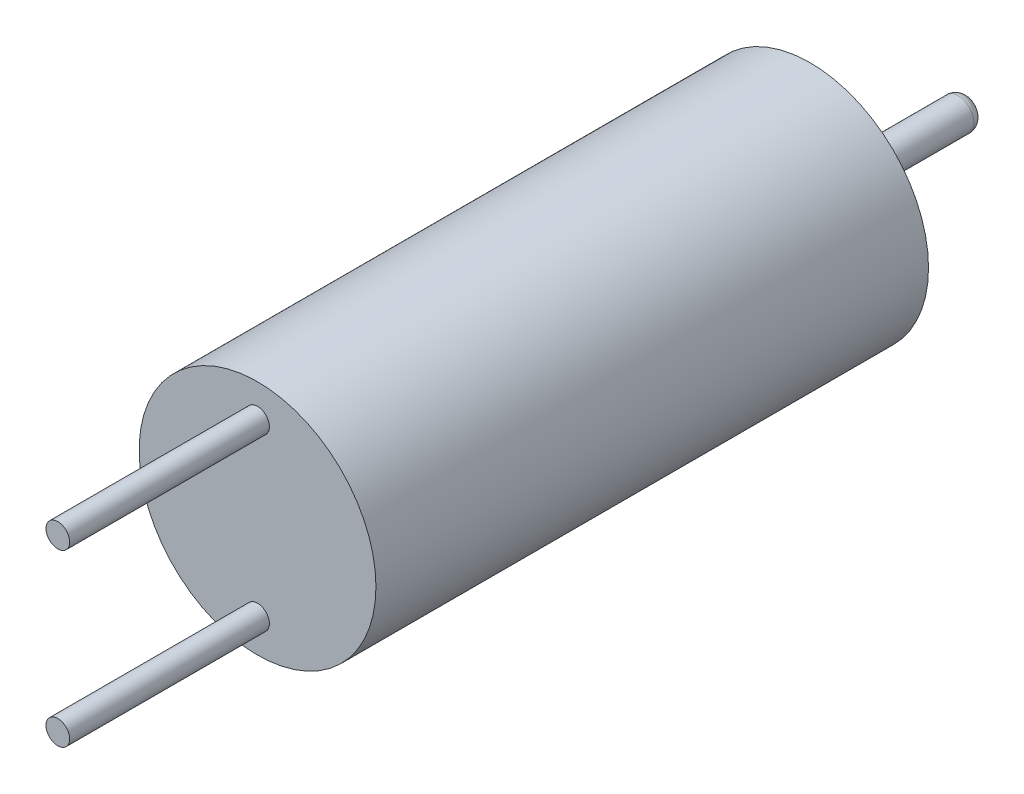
from build123d import *

# Parameters (mm, degrees)
ESQUISSE1_W        = 3
ESQUISSE1_H        = 14
ESQUISSE2_R        = 1
BOSS_EXTRU_1_DEPTH = 0.3
ESQUISSE3_R        = 0.4
BOSS_EXTRU_2_DEPTH = 3.7
ESQUISSE4_W        = 0.3
ESQUISSE4_H        = 5.06
ESQUISSE5_W        = 0.3
ESQUISSE5_H        = 5.06
CONG_1_R           = 0.25


with BuildPart() as part:
    # Esquisse1 → R_volution1 (revolve)
    with BuildSketch(Plane(origin=(0, 0, 0), x_dir=(1, 0, 0), z_dir=(0, 1, 0))):
        with Locations((1.5, -18.2)):
            Rectangle(ESQUISSE1_W, ESQUISSE1_H)
    revolve(axis=Axis((0, 0, 11.2), (0, 0, 1)))

    # Esquisse2 → Boss.-Extru.1 (add)
    with BuildSketch(Plane(origin=(0, 0, 11.2), x_dir=(-1, 0, 0), z_dir=(0, 0, -1))):
        Circle(ESQUISSE2_R)
    extrude(amount=BOSS_EXTRU_1_DEPTH)

    # Esquisse3 → Boss.-Extru.2 (add)
    with BuildSketch(Plane(origin=(0, 0, 10.9), x_dir=(-1, 0, 0), z_dir=(0, 0, -1))):
        Circle(ESQUISSE3_R)
    extrude(amount=BOSS_EXTRU_2_DEPTH)

    # Esquisse4 → R_volution2 (revolve)
    with BuildSketch(Plane(origin=(0, -2.16, 0), x_dir=(-1, 0, 0), z_dir=(0, 1, 0))):
        with Locations((-0.15, 27.73)):
            Rectangle(ESQUISSE4_W, ESQUISSE4_H)
    revolve(axis=Axis((0, -2.16, 25.2), (0, 0, 1)))

    # Esquisse5 → R_volution3 (revolve)
    with BuildSketch(Plane(origin=(0, 2.16, 0), x_dir=(-1, 0, 0), z_dir=(0, 1, 0))):
        with Locations((-0.15, 27.73)):
            Rectangle(ESQUISSE5_W, ESQUISSE5_H)
    revolve(axis=Axis((0, 2.16, 25.2), (0, 0, 1)))

    # Cong_1
    cong_1_edges = [part.edges().sort_by_distance(p)[0] for p in [
        (0.4, 0, 7.2),
    ]]
    fillet(cong_1_edges, radius=CONG_1_R)


solid = part.part
